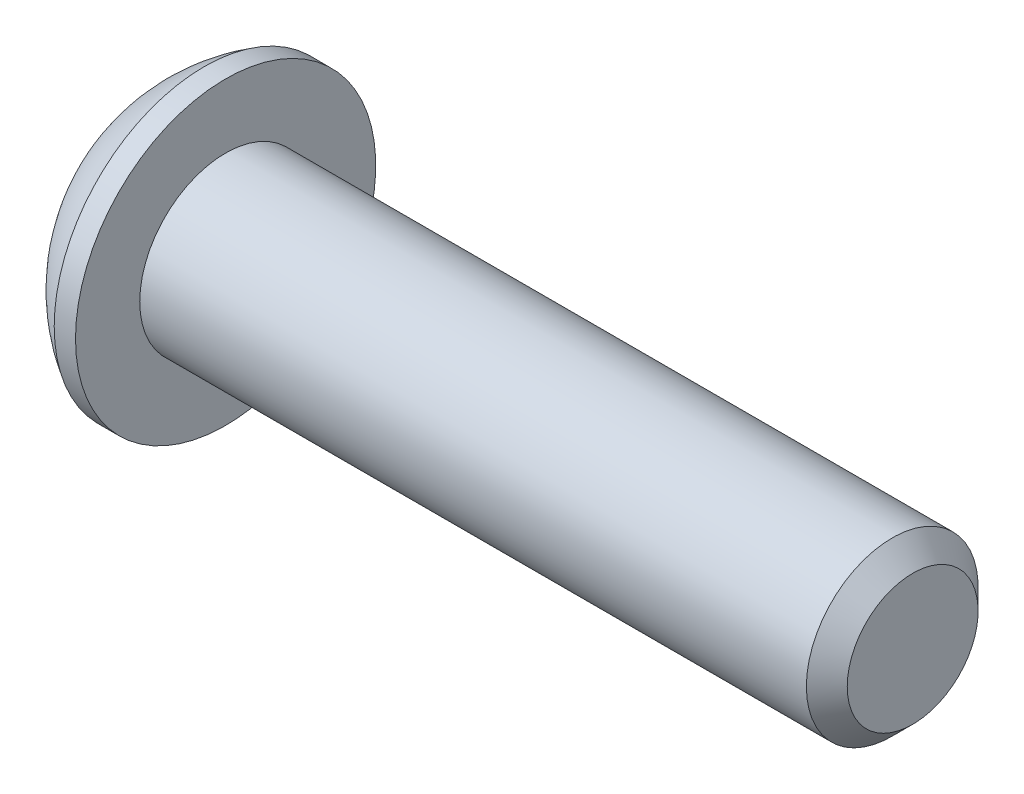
ISO-10303-21;
HEADER;
FILE_DESCRIPTION(('STEP AP214'),'2;1');
FILE_NAME('part.step','',(''),(''),'','','');
FILE_SCHEMA(('AUTOMOTIVE_DESIGN { 1 0 10303 214 1 1 1 1 }'));
ENDSEC;
DATA;
#1=APPLICATION_CONTEXT('core data for automotive mechanical design processes');
#2=APPLICATION_PROTOCOL_DEFINITION('international standard','automotive_design',2000,#1);
#3=PRODUCT_CONTEXT('',#1,'mechanical');
#4=PRODUCT('Part','Part','',(#3));
#5=PRODUCT_RELATED_PRODUCT_CATEGORY('part','',(#4));
#6=PRODUCT_DEFINITION_FORMATION('','',#4);
#7=PRODUCT_DEFINITION_CONTEXT('part definition',#1,'design');
#8=PRODUCT_DEFINITION('design','',#6,#7);
#9=PRODUCT_DEFINITION_SHAPE('','',#8);
#10=(LENGTH_UNIT() NAMED_UNIT(*) SI_UNIT(.MILLI.,.METRE.));
#11=(NAMED_UNIT(*) PLANE_ANGLE_UNIT() SI_UNIT($,.RADIAN.));
#12=(NAMED_UNIT(*) SI_UNIT($,.STERADIAN.) SOLID_ANGLE_UNIT());
#13=UNCERTAINTY_MEASURE_WITH_UNIT(LENGTH_MEASURE(1.E-05),#10,'distance_accuracy_value','');
#14=(GEOMETRIC_REPRESENTATION_CONTEXT(3) GLOBAL_UNCERTAINTY_ASSIGNED_CONTEXT((#13)) GLOBAL_UNIT_ASSIGNED_CONTEXT((#10,
#11,#12)) REPRESENTATION_CONTEXT('',''));
#15=CARTESIAN_POINT('',(0.,0.,0.));
#16=DIRECTION('',(0.,0.,1.));
#17=DIRECTION('',(1.,0.,0.));
#18=AXIS2_PLACEMENT_3D('',#15,#16,#17);
#19=CARTESIAN_POINT('',(0.,0.,0.));
#20=DIRECTION('',(-1.,0.,0.));
#21=DIRECTION('',(0.,0.,1.));
#22=AXIS2_PLACEMENT_3D('',#19,#20,#21);
#23=PLANE('',#22);
#24=CARTESIAN_POINT('',(0.,0.,0.));
#25=DIRECTION('',(-1.,0.,0.));
#26=DIRECTION('',(0.,0.,1.));
#27=AXIS2_PLACEMENT_3D('',#24,#25,#26);
#28=CIRCLE('',#27,2.77495);
#29=CARTESIAN_POINT('',(0.,2.77495,0.));
#30=VERTEX_POINT('',#29);
#31=EDGE_CURVE('E11',#30,#30,#28,.T.);
#32=ORIENTED_EDGE('',*,*,#31,.T.);
#33=EDGE_LOOP('',(#32));
#34=FACE_BOUND('',#33,.T.);
#35=DIRECTION('',(0.,-1.,0.));
#36=VECTOR('',#35,1.);
#37=CARTESIAN_POINT('',(0.,-1.14384635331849,1.9812));
#38=LINE('',#37,#36);
#39=CARTESIAN_POINT('',(0.,1.14384635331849,1.9812));
#40=VERTEX_POINT('',#39);
#41=CARTESIAN_POINT('',(0.,-1.14384635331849,1.9812));
#42=VERTEX_POINT('',#41);
#43=EDGE_CURVE('E46',#40,#42,#38,.T.);
#44=ORIENTED_EDGE('',*,*,#43,.T.);
#45=DIRECTION('',(0.,-0.5,-0.866025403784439));
#46=VECTOR('',#45,1.);
#47=CARTESIAN_POINT('',(0.,-2.28769270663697,0.));
#48=LINE('',#47,#46);
#49=CARTESIAN_POINT('',(0.,-2.28769270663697,0.));
#50=VERTEX_POINT('',#49);
#51=EDGE_CURVE('E362',#42,#50,#48,.T.);
#52=ORIENTED_EDGE('',*,*,#51,.T.);
#53=DIRECTION('',(0.,0.5,-0.866025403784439));
#54=VECTOR('',#53,1.);
#55=CARTESIAN_POINT('',(0.,-1.14384635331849,-1.9812));
#56=LINE('',#55,#54);
#57=CARTESIAN_POINT('',(0.,-1.14384635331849,-1.9812));
#58=VERTEX_POINT('',#57);
#59=EDGE_CURVE('E126',#50,#58,#56,.T.);
#60=ORIENTED_EDGE('',*,*,#59,.T.);
#61=DIRECTION('',(0.,1.,0.));
#62=VECTOR('',#61,1.);
#63=CARTESIAN_POINT('',(0.,1.14384635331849,-1.9812));
#64=LINE('',#63,#62);
#65=CARTESIAN_POINT('',(0.,1.14384635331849,-1.9812));
#66=VERTEX_POINT('',#65);
#67=EDGE_CURVE('E365',#58,#66,#64,.T.);
#68=ORIENTED_EDGE('',*,*,#67,.T.);
#69=DIRECTION('',(0.,0.5,0.866025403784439));
#70=VECTOR('',#69,1.);
#71=CARTESIAN_POINT('',(0.,2.28769270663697,0.));
#72=LINE('',#71,#70);
#73=CARTESIAN_POINT('',(0.,2.28769270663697,0.));
#74=VERTEX_POINT('',#73);
#75=EDGE_CURVE('E367',#66,#74,#72,.T.);
#76=ORIENTED_EDGE('',*,*,#75,.T.);
#77=DIRECTION('',(0.,-0.5,0.866025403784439));
#78=VECTOR('',#77,1.);
#79=CARTESIAN_POINT('',(0.,1.14384635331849,1.9812));
#80=LINE('',#79,#78);
#81=EDGE_CURVE('E369',#74,#40,#80,.T.);
#82=ORIENTED_EDGE('',*,*,#81,.T.);
#83=EDGE_LOOP('',(#44,#52,#60,#68,#76,#82));
#84=FACE_BOUND('',#83,.T.);
#85=ADVANCED_FACE('F32',(#34,#84),#23,.T.);
#86=CARTESIAN_POINT('',(5.78512506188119,0.,0.));
#87=DIRECTION('',(-1.,0.,0.));
#88=DIRECTION('',(0.,1.,0.));
#89=AXIS2_PLACEMENT_3D('',#86,#87,#88);
#90=SPHERICAL_SURFACE('',#89,6.41623094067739);
#91=CARTESIAN_POINT('',(2.5654,0.,0.));
#92=DIRECTION('',(-1.,0.,0.));
#93=DIRECTION('',(0.,0.,1.));
#94=AXIS2_PLACEMENT_3D('',#91,#92,#93);
#95=CIRCLE('',#94,5.5499);
#96=CARTESIAN_POINT('',(2.5654,5.5499,0.));
#97=VERTEX_POINT('',#96);
#98=EDGE_CURVE('E39',#97,#97,#95,.T.);
#99=CARTESIAN_POINT('',(2.5654,5.5499,0.));
#100=CARTESIAN_POINT('',(2.53083708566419,5.52984868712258,0.));
#101=CARTESIAN_POINT('',(2.49646152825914,5.50947442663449,0.));
#102=CARTESIAN_POINT('',(2.42809701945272,5.4680872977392,0.));
#103=CARTESIAN_POINT('',(2.39410806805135,5.447074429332,0.));
#104=CARTESIAN_POINT('',(2.32652866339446,5.40441737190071,0.));
#105=CARTESIAN_POINT('',(2.29293821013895,5.38277318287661,0.));
#106=CARTESIAN_POINT('',(2.22616751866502,5.33886105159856,0.));
#107=CARTESIAN_POINT('',(2.19298728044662,5.3165931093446,0.));
#108=CARTESIAN_POINT('',(2.12704860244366,5.27144124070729,0.));
#109=CARTESIAN_POINT('',(2.09429016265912,5.24855731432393,0.));
#110=CARTESIAN_POINT('',(2.02920651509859,5.20218146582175,0.));
#111=CARTESIAN_POINT('',(1.99688130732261,5.17868954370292,0.));
#112=CARTESIAN_POINT('',(1.93267540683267,5.13110590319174,0.));
#113=CARTESIAN_POINT('',(1.90079471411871,5.10701418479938,0.));
#114=CARTESIAN_POINT('',(1.83748897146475,5.05823936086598,0.));
#115=CARTESIAN_POINT('',(1.80606392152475,5.03355625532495,0.));
#116=CARTESIAN_POINT('',(1.74368043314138,4.98360727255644,0.));
#117=CARTESIAN_POINT('',(1.71272199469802,4.95834139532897,0.));
#118=CARTESIAN_POINT('',(1.65128253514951,4.90723568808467,0.));
#119=CARTESIAN_POINT('',(1.62080151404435,4.88139585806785,0.));
#120=CARTESIAN_POINT('',(1.56032752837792,4.82915126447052,0.));
#121=CARTESIAN_POINT('',(1.53033456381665,4.80274650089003,0.));
#122=CARTESIAN_POINT('',(1.4708471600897,4.74938125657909,0.));
#123=CARTESIAN_POINT('',(1.44135272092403,4.72242077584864,0.));
#124=CARTESIAN_POINT('',(1.38287266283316,4.66795350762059,0.));
#125=CARTESIAN_POINT('',(1.35388704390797,4.64044672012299,0.));
#126=CARTESIAN_POINT('',(1.29643474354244,4.58489643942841,0.));
#127=CARTESIAN_POINT('',(1.26796806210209,4.55685294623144,0.));
#128=CARTESIAN_POINT('',(1.21156357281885,4.50023904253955,0.));
#129=CARTESIAN_POINT('',(1.18362576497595,4.47166863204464,0.));
#130=CARTESIAN_POINT('',(1.12828877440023,4.41401086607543,0.));
#131=CARTESIAN_POINT('',(1.10088959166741,4.38492351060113,0.));
#132=CARTESIAN_POINT('',(1.04663941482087,4.32624200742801,0.));
#133=CARTESIAN_POINT('',(1.01978842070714,4.2966478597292,0.));
#134=CARTESIAN_POINT('',(0.966643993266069,4.2369631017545,0.));
#135=CARTESIAN_POINT('',(0.94035055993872,4.20687249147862,0.));
#136=CARTESIAN_POINT('',(0.888330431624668,4.14620531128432,0.));
#137=CARTESIAN_POINT('',(0.862603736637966,4.11562874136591,0.));
#138=CARTESIAN_POINT('',(0.811726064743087,4.05400031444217,0.));
#139=CARTESIAN_POINT('',(0.786575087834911,4.02294845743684,0.));
#140=CARTESIAN_POINT('',(0.736857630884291,3.96038029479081,0.));
#141=CARTESIAN_POINT('',(0.712291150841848,3.9288639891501,0.));
#142=CARTESIAN_POINT('',(0.6637512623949,3.8653779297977,0.));
#143=CARTESIAN_POINT('',(0.639777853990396,3.833408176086,0.));
#144=CARTESIAN_POINT('',(0.592432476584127,3.76902637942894,0.));
#145=CARTESIAN_POINT('',(0.569060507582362,3.73661433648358,0.));
#146=CARTESIAN_POINT('',(0.522926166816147,3.67135927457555,0.));
#147=CARTESIAN_POINT('',(0.500163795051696,3.63851625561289,0.));
#148=CARTESIAN_POINT('',(0.455256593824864,3.57241070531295,0.));
#149=CARTESIAN_POINT('',(0.433111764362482,3.53914817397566,0.));
#150=CARTESIAN_POINT('',(0.389447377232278,3.47221520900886,0.));
#151=CARTESIAN_POINT('',(0.367927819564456,3.43854477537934,0.));
#152=CARTESIAN_POINT('',(0.325521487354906,3.37080775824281,0.));
#153=CARTESIAN_POINT('',(0.304634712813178,3.3367411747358,0.));
#154=CARTESIAN_POINT('',(0.263501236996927,3.26822374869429,0.));
#155=CARTESIAN_POINT('',(0.243254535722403,3.23377290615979,0.));
#156=CARTESIAN_POINT('',(0.203408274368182,3.16449898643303,0.));
#157=CARTESIAN_POINT('',(0.183808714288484,3.12967590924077,0.));
#158=CARTESIAN_POINT('',(0.14526357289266,3.05966967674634,0.));
#159=CARTESIAN_POINT('',(0.126317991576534,3.02448652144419,0.));
#160=CARTESIAN_POINT('',(0.089087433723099,2.95377240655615,0.));
#161=CARTESIAN_POINT('',(0.0708024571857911,2.91824144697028,0.));
#162=CARTESIAN_POINT('',(0.0348994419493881,2.84684415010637,0.));
#163=CARTESIAN_POINT('',(0.017281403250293,2.81097781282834,0.));
#164=CARTESIAN_POINT('',(0.,2.77495,0.));
#165=B_SPLINE_CURVE_WITH_KNOTS('',3,(#99,#100,#101,#102,#103,#104,#105,#106,#107,#108,#109,#110,
#111,#112,#113,#114,#115,#116,#117,#118,#119,#120,#121,#122,#123,#124,#125,#126,#127,#128,#129,
#130,#131,#132,#133,#134,#135,#136,#137,#138,#139,#140,#141,#142,#143,#144,#145,#146,#147,#148,
#149,#150,#151,#152,#153,#154,#155,#156,#157,#158,#159,#160,#161,#162,#163,#164),.UNSPECIFIED.,
.F.,.F.,(4,2,2,2,2,2,2,2,2,2,2,2,2,2,2,2,2,2,2,2,2,2,2,2,2,2,2,2,2,2,2,2,4),(0.,
0.119872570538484,0.239745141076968,0.359617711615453,0.479490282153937,0.599362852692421,
0.719235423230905,0.83910799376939,0.958980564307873,1.07885313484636,1.19872570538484,
1.31859827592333,1.43847084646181,1.55834341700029,1.67821598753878,1.79808855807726,
1.91796112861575,2.03783369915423,2.15770626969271,2.2775788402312,2.39745141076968,
2.51732398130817,2.63719655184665,2.75706912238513,2.87694169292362,2.9968142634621,
3.11668683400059,3.23655940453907,3.35643197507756,3.47630454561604,3.59617711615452,
3.71604968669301,3.83592225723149),.UNSPECIFIED.);
#166=EDGE_CURVE('BSEAM153',#97,#30,#165,.T.);
#167=ORIENTED_EDGE('',*,*,#98,.T.);
#168=ORIENTED_EDGE('',*,*,#31,.F.);
#169=ORIENTED_EDGE('',*,*,#166,.T.);
#170=ORIENTED_EDGE('',*,*,#166,.F.);
#171=EDGE_LOOP('',(#167,#169,#168,#170));
#172=FACE_BOUND('',#171,.T.);
#173=ADVANCED_FACE('F153',(#172),#90,.T.);
#174=CARTESIAN_POINT('',(0.,0.,0.));
#175=DIRECTION('',(-1.,0.,0.));
#176=DIRECTION('',(0.,0.,1.));
#177=AXIS2_PLACEMENT_3D('',#174,#175,#176);
#178=CYLINDRICAL_SURFACE('',#177,5.5499);
#179=ORIENTED_EDGE('',*,*,#98,.F.);
#180=EDGE_LOOP('',(#179));
#181=FACE_BOUND('',#180,.T.);
#182=CARTESIAN_POINT('',(3.3528,0.,0.));
#183=DIRECTION('',(-1.,0.,0.));
#184=DIRECTION('',(0.,0.,1.));
#185=AXIS2_PLACEMENT_3D('',#182,#183,#184);
#186=CIRCLE('',#185,5.5499);
#187=CARTESIAN_POINT('',(3.3528,0.,5.5499));
#188=VERTEX_POINT('',#187);
#189=EDGE_CURVE('E148',#188,#188,#186,.T.);
#190=ORIENTED_EDGE('',*,*,#189,.T.);
#191=EDGE_LOOP('',(#190));
#192=FACE_BOUND('',#191,.T.);
#193=ADVANCED_FACE('F156',(#181,#192),#178,.T.);
#194=CARTESIAN_POINT('',(3.3528,3.17499999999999,0.));
#195=DIRECTION('',(-1.,0.,0.));
#196=DIRECTION('',(0.,0.,1.));
#197=AXIS2_PLACEMENT_3D('',#194,#195,#196);
#198=PLANE('',#197);
#199=ORIENTED_EDGE('',*,*,#189,.F.);
#200=EDGE_LOOP('',(#199));
#201=FACE_BOUND('',#200,.T.);
#202=CARTESIAN_POINT('',(3.3528,0.,0.));
#203=DIRECTION('',(-1.,0.,0.));
#204=DIRECTION('',(0.,0.,1.));
#205=AXIS2_PLACEMENT_3D('',#202,#203,#204);
#206=CIRCLE('',#205,3.17499999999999);
#207=CARTESIAN_POINT('',(3.3528,0.,3.17499999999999));
#208=VERTEX_POINT('',#207);
#209=EDGE_CURVE('E145',#208,#208,#206,.T.);
#210=ORIENTED_EDGE('',*,*,#209,.T.);
#211=EDGE_LOOP('',(#210));
#212=FACE_BOUND('',#211,.T.);
#213=ADVANCED_FACE('F159',(#201,#212),#198,.F.);
#214=CARTESIAN_POINT('',(0.,0.,0.));
#215=DIRECTION('',(-1.,0.,0.));
#216=DIRECTION('',(0.,0.,1.));
#217=AXIS2_PLACEMENT_3D('',#214,#215,#216);
#218=CYLINDRICAL_SURFACE('',#217,3.175);
#219=ORIENTED_EDGE('',*,*,#209,.F.);
#220=EDGE_LOOP('',(#219));
#221=FACE_BOUND('',#220,.T.);
#222=CARTESIAN_POINT('',(27.99715,0.,0.));
#223=DIRECTION('',(-1.,0.,0.));
#224=DIRECTION('',(0.,0.,1.));
#225=AXIS2_PLACEMENT_3D('',#222,#223,#224);
#226=CIRCLE('',#225,3.17500000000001);
#227=CARTESIAN_POINT('',(27.99715,0.,3.17500000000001));
#228=VERTEX_POINT('',#227);
#229=EDGE_CURVE('E142',#228,#228,#226,.T.);
#230=ORIENTED_EDGE('',*,*,#229,.T.);
#231=EDGE_LOOP('',(#230));
#232=FACE_BOUND('',#231,.T.);
#233=ADVANCED_FACE('F165',(#221,#232),#218,.T.);
#234=CARTESIAN_POINT('',(28.7528,0.,0.));
#235=DIRECTION('',(-1.,0.,0.));
#236=DIRECTION('',(0.,0.,1.));
#237=AXIS2_PLACEMENT_3D('',#234,#235,#236);
#238=CONICAL_SURFACE('',#237,2.41935,0.785398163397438);
#239=ORIENTED_EDGE('',*,*,#229,.F.);
#240=EDGE_LOOP('',(#239));
#241=FACE_BOUND('',#240,.T.);
#242=CARTESIAN_POINT('',(28.7528,0.,0.));
#243=DIRECTION('',(-1.,0.,0.));
#244=DIRECTION('',(0.,0.,1.));
#245=AXIS2_PLACEMENT_3D('',#242,#243,#244);
#246=CIRCLE('',#245,2.41935);
#247=CARTESIAN_POINT('',(28.7528,0.,2.41935));
#248=VERTEX_POINT('',#247);
#249=EDGE_CURVE('E138',#248,#248,#246,.T.);
#250=ORIENTED_EDGE('',*,*,#249,.T.);
#251=EDGE_LOOP('',(#250));
#252=FACE_BOUND('',#251,.T.);
#253=ADVANCED_FACE('F171',(#241,#252),#238,.T.);
#254=CARTESIAN_POINT('',(28.7528,0.,0.));
#255=DIRECTION('',(-1.,0.,0.));
#256=DIRECTION('',(0.,0.,1.));
#257=AXIS2_PLACEMENT_3D('',#254,#255,#256);
#258=PLANE('',#257);
#259=ORIENTED_EDGE('',*,*,#249,.F.);
#260=EDGE_LOOP('',(#259));
#261=FACE_BOUND('',#260,.T.);
#262=ADVANCED_FACE('F177',(#261),#258,.F.);
#263=CARTESIAN_POINT('',(2.2098,-2.28769270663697,0.));
#264=DIRECTION('',(0.,0.866025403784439,-0.5));
#265=DIRECTION('',(0.,0.5,0.866025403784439));
#266=AXIS2_PLACEMENT_3D('',#263,#264,#265);
#267=PLANE('',#266);
#268=DIRECTION('',(0.,-0.5,-0.866025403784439));
#269=VECTOR('',#268,1.);
#270=CARTESIAN_POINT('',(2.2098,-2.28769270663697,0.));
#271=LINE('',#270,#269);
#272=CARTESIAN_POINT('',(2.2098,-1.14384635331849,1.9812));
#273=VERTEX_POINT('',#272);
#274=CARTESIAN_POINT('',(2.2098,-1.71576952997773,0.9906));
#275=VERTEX_POINT('',#274);
#276=EDGE_CURVE('E112',#273,#275,#271,.T.);
#277=ORIENTED_EDGE('',*,*,#276,.T.);
#278=CARTESIAN_POINT('',(2.2098,-2.28769270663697,0.));
#279=VERTEX_POINT('',#278);
#280=EDGE_CURVE('E107',#275,#279,#271,.T.);
#281=ORIENTED_EDGE('',*,*,#280,.T.);
#282=DIRECTION('',(-1.,0.,0.));
#283=VECTOR('',#282,1.);
#284=CARTESIAN_POINT('',(2.2098,-2.28769270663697,0.));
#285=LINE('',#284,#283);
#286=EDGE_CURVE('E109',#279,#50,#285,.T.);
#287=ORIENTED_EDGE('',*,*,#286,.T.);
#288=ORIENTED_EDGE('',*,*,#51,.F.);
#289=DIRECTION('',(-1.,0.,0.));
#290=VECTOR('',#289,1.);
#291=CARTESIAN_POINT('',(2.2098,-1.14384635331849,1.9812));
#292=LINE('',#291,#290);
#293=EDGE_CURVE('E357',#273,#42,#292,.T.);
#294=ORIENTED_EDGE('',*,*,#293,.F.);
#295=EDGE_LOOP('',(#277,#281,#287,#288,#294));
#296=FACE_BOUND('',#295,.T.);
#297=ADVANCED_FACE('F108',(#296),#267,.T.);
#298=CARTESIAN_POINT('',(2.2098,-1.14384635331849,-1.9812));
#299=DIRECTION('',(0.,0.866025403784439,0.5));
#300=DIRECTION('',(0.,-0.5,0.866025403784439));
#301=AXIS2_PLACEMENT_3D('',#298,#299,#300);
#302=PLANE('',#301);
#303=DIRECTION('',(0.,0.5,-0.866025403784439));
#304=VECTOR('',#303,1.);
#305=CARTESIAN_POINT('',(2.2098,-1.14384635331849,-1.9812));
#306=LINE('',#305,#304);
#307=CARTESIAN_POINT('',(2.2098,-1.71576952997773,-0.9906));
#308=VERTEX_POINT('',#307);
#309=EDGE_CURVE('E54',#279,#308,#306,.T.);
#310=ORIENTED_EDGE('',*,*,#309,.T.);
#311=CARTESIAN_POINT('',(2.2098,-1.14384635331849,-1.9812));
#312=VERTEX_POINT('',#311);
#313=EDGE_CURVE('E121',#308,#312,#306,.T.);
#314=ORIENTED_EDGE('',*,*,#313,.T.);
#315=DIRECTION('',(-1.,0.,0.));
#316=VECTOR('',#315,1.);
#317=CARTESIAN_POINT('',(2.2098,-1.14384635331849,-1.9812));
#318=LINE('',#317,#316);
#319=EDGE_CURVE('E128',#312,#58,#318,.T.);
#320=ORIENTED_EDGE('',*,*,#319,.T.);
#321=ORIENTED_EDGE('',*,*,#59,.F.);
#322=ORIENTED_EDGE('',*,*,#286,.F.);
#323=EDGE_LOOP('',(#310,#314,#320,#321,#322));
#324=FACE_BOUND('',#323,.T.);
#325=ADVANCED_FACE('F124',(#324),#302,.T.);
#326=CARTESIAN_POINT('',(2.2098,1.14384635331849,-1.9812));
#327=DIRECTION('',(0.,0.,1.));
#328=DIRECTION('',(1.,0.,0.));
#329=AXIS2_PLACEMENT_3D('',#326,#327,#328);
#330=PLANE('',#329);
#331=DIRECTION('',(0.,1.,0.));
#332=VECTOR('',#331,1.);
#333=CARTESIAN_POINT('',(2.2098,1.14384635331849,-1.9812));
#334=LINE('',#333,#332);
#335=CARTESIAN_POINT('',(2.2098,0.,-1.9812));
#336=VERTEX_POINT('',#335);
#337=EDGE_CURVE('E387',#312,#336,#334,.T.);
#338=ORIENTED_EDGE('',*,*,#337,.T.);
#339=CARTESIAN_POINT('',(2.2098,1.14384635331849,-1.9812));
#340=VERTEX_POINT('',#339);
#341=EDGE_CURVE('E120',#336,#340,#334,.T.);
#342=ORIENTED_EDGE('',*,*,#341,.T.);
#343=DIRECTION('',(-1.,0.,0.));
#344=VECTOR('',#343,1.);
#345=CARTESIAN_POINT('',(2.2098,1.14384635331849,-1.9812));
#346=LINE('',#345,#344);
#347=EDGE_CURVE('E133',#340,#66,#346,.T.);
#348=ORIENTED_EDGE('',*,*,#347,.T.);
#349=ORIENTED_EDGE('',*,*,#67,.F.);
#350=ORIENTED_EDGE('',*,*,#319,.F.);
#351=EDGE_LOOP('',(#338,#342,#348,#349,#350));
#352=FACE_BOUND('',#351,.T.);
#353=ADVANCED_FACE('F236',(#352),#330,.T.);
#354=CARTESIAN_POINT('',(2.2098,2.28769270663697,0.));
#355=DIRECTION('',(0.,-0.866025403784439,0.5));
#356=DIRECTION('',(0.,-0.5,-0.866025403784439));
#357=AXIS2_PLACEMENT_3D('',#354,#355,#356);
#358=PLANE('',#357);
#359=DIRECTION('',(0.,0.5,0.866025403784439));
#360=VECTOR('',#359,1.);
#361=CARTESIAN_POINT('',(2.2098,2.28769270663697,0.));
#362=LINE('',#361,#360);
#363=CARTESIAN_POINT('',(2.2098,1.71576952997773,-0.990600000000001));
#364=VERTEX_POINT('',#363);
#365=EDGE_CURVE('E391',#340,#364,#362,.T.);
#366=ORIENTED_EDGE('',*,*,#365,.T.);
#367=CARTESIAN_POINT('',(2.2098,2.28769270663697,0.));
#368=VERTEX_POINT('',#367);
#369=EDGE_CURVE('E389',#364,#368,#362,.T.);
#370=ORIENTED_EDGE('',*,*,#369,.T.);
#371=DIRECTION('',(-1.,0.,0.));
#372=VECTOR('',#371,1.);
#373=CARTESIAN_POINT('',(2.2098,2.28769270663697,0.));
#374=LINE('',#373,#372);
#375=EDGE_CURVE('E373',#368,#74,#374,.T.);
#376=ORIENTED_EDGE('',*,*,#375,.T.);
#377=ORIENTED_EDGE('',*,*,#75,.F.);
#378=ORIENTED_EDGE('',*,*,#347,.F.);
#379=EDGE_LOOP('',(#366,#370,#376,#377,#378));
#380=FACE_BOUND('',#379,.T.);
#381=ADVANCED_FACE('F245',(#380),#358,.T.);
#382=CARTESIAN_POINT('',(2.2098,1.14384635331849,1.9812));
#383=DIRECTION('',(0.,-0.866025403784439,-0.5));
#384=DIRECTION('',(0.,0.5,-0.866025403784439));
#385=AXIS2_PLACEMENT_3D('',#382,#383,#384);
#386=PLANE('',#385);
#387=DIRECTION('',(0.,-0.5,0.866025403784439));
#388=VECTOR('',#387,1.);
#389=CARTESIAN_POINT('',(2.2098,1.14384635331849,1.9812));
#390=LINE('',#389,#388);
#391=CARTESIAN_POINT('',(2.2098,1.71576952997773,0.990600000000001));
#392=VERTEX_POINT('',#391);
#393=EDGE_CURVE('E352',#368,#392,#390,.T.);
#394=ORIENTED_EDGE('',*,*,#393,.T.);
#395=CARTESIAN_POINT('',(2.2098,1.14384635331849,1.9812));
#396=VERTEX_POINT('',#395);
#397=EDGE_CURVE('E348',#392,#396,#390,.T.);
#398=ORIENTED_EDGE('',*,*,#397,.T.);
#399=DIRECTION('',(-1.,0.,0.));
#400=VECTOR('',#399,1.);
#401=CARTESIAN_POINT('',(2.2098,1.14384635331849,1.9812));
#402=LINE('',#401,#400);
#403=EDGE_CURVE('E356',#396,#40,#402,.T.);
#404=ORIENTED_EDGE('',*,*,#403,.T.);
#405=ORIENTED_EDGE('',*,*,#81,.F.);
#406=ORIENTED_EDGE('',*,*,#375,.F.);
#407=EDGE_LOOP('',(#394,#398,#404,#405,#406));
#408=FACE_BOUND('',#407,.T.);
#409=ADVANCED_FACE('F255',(#408),#386,.T.);
#410=CARTESIAN_POINT('',(2.2098,-1.14384635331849,1.9812));
#411=DIRECTION('',(0.,0.,-1.));
#412=DIRECTION('',(0.,1.,0.));
#413=AXIS2_PLACEMENT_3D('',#410,#411,#412);
#414=PLANE('',#413);
#415=DIRECTION('',(0.,-1.,0.));
#416=VECTOR('',#415,1.);
#417=CARTESIAN_POINT('',(2.2098,-1.14384635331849,1.9812));
#418=LINE('',#417,#416);
#419=CARTESIAN_POINT('',(2.2098,0.,1.9812));
#420=VERTEX_POINT('',#419);
#421=EDGE_CURVE('E347',#396,#420,#418,.T.);
#422=ORIENTED_EDGE('',*,*,#421,.T.);
#423=EDGE_CURVE('E350',#420,#273,#418,.T.);
#424=ORIENTED_EDGE('',*,*,#423,.T.);
#425=ORIENTED_EDGE('',*,*,#293,.T.);
#426=ORIENTED_EDGE('',*,*,#43,.F.);
#427=ORIENTED_EDGE('',*,*,#403,.F.);
#428=EDGE_LOOP('',(#422,#424,#425,#426,#427));
#429=FACE_BOUND('',#428,.T.);
#430=ADVANCED_FACE('F265',(#429),#414,.T.);
#431=CARTESIAN_POINT('',(2.2098,-2.28769270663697,0.));
#432=DIRECTION('',(1.,0.,0.));
#433=DIRECTION('',(0.,0.,-1.));
#434=AXIS2_PLACEMENT_3D('',#431,#432,#433);
#435=PLANE('',#434);
#436=CARTESIAN_POINT('',(2.2098,0.,0.));
#437=DIRECTION('',(-1.,0.,0.));
#438=DIRECTION('',(0.,0.,1.));
#439=AXIS2_PLACEMENT_3D('',#436,#437,#438);
#440=CIRCLE('',#439,1.9812);
#441=EDGE_CURVE('E394',#364,#336,#440,.T.);
#442=ORIENTED_EDGE('',*,*,#441,.F.);
#443=ORIENTED_EDGE('',*,*,#365,.F.);
#444=ORIENTED_EDGE('',*,*,#341,.F.);
#445=EDGE_LOOP('',(#442,#443,#444));
#446=FACE_BOUND('',#445,.T.);
#447=ADVANCED_FACE('F275',(#446),#435,.F.);
#448=EDGE_CURVE('E139',#392,#364,#440,.T.);
#449=ORIENTED_EDGE('',*,*,#448,.F.);
#450=ORIENTED_EDGE('',*,*,#393,.F.);
#451=ORIENTED_EDGE('',*,*,#369,.F.);
#452=EDGE_LOOP('',(#449,#450,#451));
#453=FACE_BOUND('',#452,.T.);
#454=ADVANCED_FACE('F285',(#453),#435,.F.);
#455=EDGE_CURVE('E132',#420,#392,#440,.T.);
#456=ORIENTED_EDGE('',*,*,#455,.F.);
#457=ORIENTED_EDGE('',*,*,#421,.F.);
#458=ORIENTED_EDGE('',*,*,#397,.F.);
#459=EDGE_LOOP('',(#456,#457,#458));
#460=FACE_BOUND('',#459,.T.);
#461=ADVANCED_FACE('F296',(#460),#435,.F.);
#462=EDGE_CURVE('E127',#275,#420,#440,.T.);
#463=ORIENTED_EDGE('',*,*,#462,.F.);
#464=ORIENTED_EDGE('',*,*,#276,.F.);
#465=ORIENTED_EDGE('',*,*,#423,.F.);
#466=EDGE_LOOP('',(#463,#464,#465));
#467=FACE_BOUND('',#466,.T.);
#468=ADVANCED_FACE('F305',(#467),#435,.F.);
#469=EDGE_CURVE('E118',#308,#275,#440,.T.);
#470=ORIENTED_EDGE('',*,*,#469,.F.);
#471=ORIENTED_EDGE('',*,*,#309,.F.);
#472=ORIENTED_EDGE('',*,*,#280,.F.);
#473=EDGE_LOOP('',(#470,#471,#472));
#474=FACE_BOUND('',#473,.T.);
#475=ADVANCED_FACE('F117',(#474),#435,.F.);
#476=EDGE_CURVE('E388',#336,#308,#440,.T.);
#477=ORIENTED_EDGE('',*,*,#476,.F.);
#478=ORIENTED_EDGE('',*,*,#337,.F.);
#479=ORIENTED_EDGE('',*,*,#313,.F.);
#480=EDGE_LOOP('',(#477,#478,#479));
#481=FACE_BOUND('',#480,.T.);
#482=ADVANCED_FACE('F288',(#481),#435,.F.);
#483=CARTESIAN_POINT('',(3.3536463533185,0.,0.));
#484=DIRECTION('',(-1.,0.,0.));
#485=DIRECTION('',(0.,0.,1.));
#486=AXIS2_PLACEMENT_3D('',#483,#484,#485);
#487=CONICAL_SURFACE('',#486,0.,1.04719755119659);
#488=ORIENTED_EDGE('',*,*,#455,.T.);
#489=ORIENTED_EDGE('',*,*,#448,.T.);
#490=ORIENTED_EDGE('',*,*,#441,.T.);
#491=ORIENTED_EDGE('',*,*,#476,.T.);
#492=ORIENTED_EDGE('',*,*,#469,.T.);
#493=ORIENTED_EDGE('',*,*,#462,.T.);
#494=EDGE_LOOP('',(#488,#489,#490,#491,#492,#493));
#495=FACE_BOUND('',#494,.T.);
#496=CARTESIAN_POINT('',(3.3536463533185,0.,0.));
#497=VERTEX_POINT('',#496);
#498=VERTEX_LOOP('',#497);
#499=FACE_BOUND('',#498,.T.);
#500=ADVANCED_FACE('F329',(#495,#499),#487,.F.);
#501=CLOSED_SHELL('',(#85,#173,#193,#213,#233,#253,#262,#297,#325,#353,#381,#409,#430,#447,#454,
#461,#468,#475,#482,#500));
#502=MANIFOLD_SOLID_BREP('B2',#501);
#503=ADVANCED_BREP_SHAPE_REPRESENTATION('',(#18,#502),#14);
#504=SHAPE_DEFINITION_REPRESENTATION(#9,#503);
ENDSEC;
END-ISO-10303-21;
